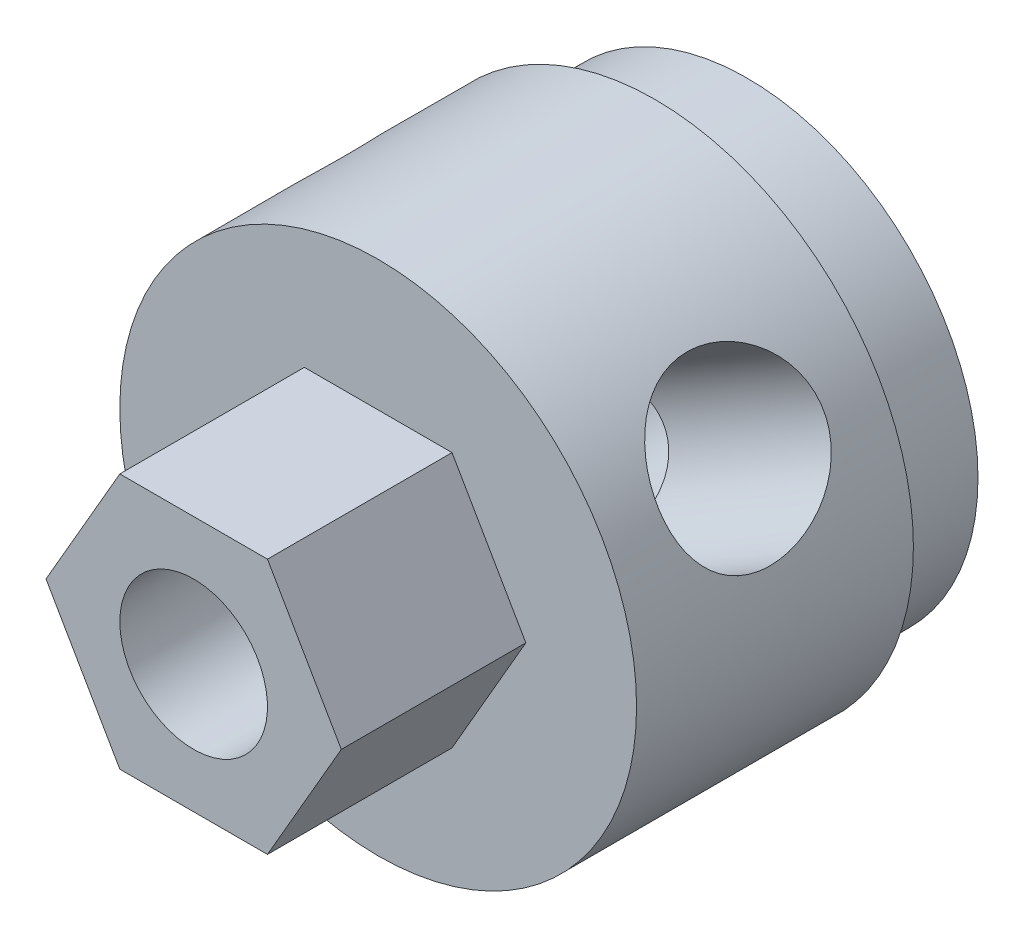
from build123d import *

# Parameters (mm, degrees)
SKETCH1_R           = 3.175
BOSS_EXTRUDE1_DEPTH = 5.08
BOSS_EXTRUDE2_DEPTH = 2.54
BOSS_EXTRUDE3_START = -3.81
SKETCH5_R           = 3.556
SKETCH5_R_2         = 3.175
BOSS_EXTRUDE3_DEPTH = 3.81
SKETCH7_R           = 1.016
CUT_EXTRUDE1_DEPTH  = 10.129877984
SKETCH8_R           = 1.143
CUT_EXTRUDE2_DEPTH  = 10.129877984
CIRPATTERN1_COUNT   = 3


with BuildPart() as part:
    # Sketch1 → Boss-Extrude1 (new body)
    with BuildSketch(Plane.XY):
        Circle(SKETCH1_R)
    extrude(amount=BOSS_EXTRUDE1_DEPTH)

    # Sketch2 → Boss-Extrude2 (add)
    with BuildSketch(Plane.XY.offset(5.08)):
        Polygon((2.032, 0), (1.016, 1.75976362), (-1.016, 1.75976362), (-2.032, 0), (-1.016, -1.75976362), (1.016, -1.75976362), align=None)
    extrude(amount=BOSS_EXTRUDE2_DEPTH)

    # Sketch5 → Boss-Extrude3 (add)
    with BuildSketch(Plane.XY.offset(5.08).offset(BOSS_EXTRUDE3_START)):
        Circle(SKETCH5_R)
        Circle(SKETCH5_R_2, mode=Mode.SUBTRACT)
    extrude(amount=BOSS_EXTRUDE3_DEPTH)

    # Sketch7 → Cut-Extrude1 (cut, through all)
    with BuildSketch(Plane(origin=(0, 0, 0), x_dir=(-1, 0, 0), z_dir=(0, 0, -1))):
        Circle(SKETCH7_R)
    extrude(amount=-CUT_EXTRUDE1_DEPTH, mode=Mode.SUBTRACT)

    # Sketch8 → Cut-Extrude2 (cut, through all)
    with BuildSketch(Plane(origin=(0, 0, 0), x_dir=(1, 0, 0), z_dir=(0, 1, 0))):
        with Locations(Location((0, -3.175, 0), (0, 0, 270))):
            Circle(SKETCH8_R)
    cut_extrude2 = extrude(amount=-CUT_EXTRUDE2_DEPTH, mode=Mode.SUBTRACT)

    # CirPattern1: Cut-Extrude2 ×3 about axis
    cirpattern1_axis = Axis((0, 0, 7.62), (0, 0, -1))
    for i in range(1, CIRPATTERN1_COUNT):
        add(cut_extrude2.rotate(cirpattern1_axis, i * 360 / CIRPATTERN1_COUNT), mode=Mode.SUBTRACT)


solid = part.part
